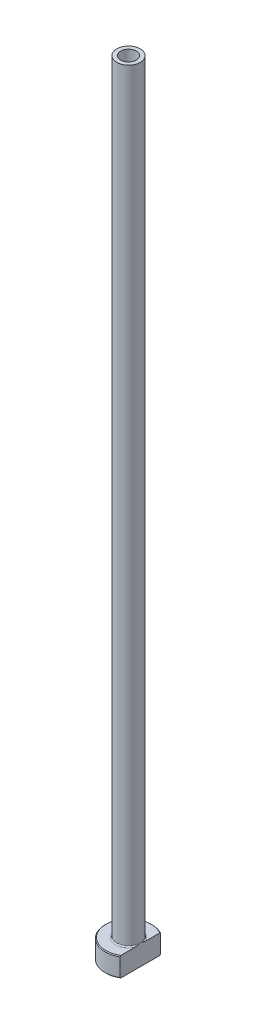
ISO-10303-21;
HEADER;
FILE_DESCRIPTION(('STEP AP214'),'2;1');
FILE_NAME('part.step','',(''),(''),'','','');
FILE_SCHEMA(('AUTOMOTIVE_DESIGN { 1 0 10303 214 1 1 1 1 }'));
ENDSEC;
DATA;
#1=APPLICATION_CONTEXT('core data for automotive mechanical design processes');
#2=APPLICATION_PROTOCOL_DEFINITION('international standard','automotive_design',2000,#1);
#3=PRODUCT_CONTEXT('',#1,'mechanical');
#4=PRODUCT('Part','Part','',(#3));
#5=PRODUCT_RELATED_PRODUCT_CATEGORY('part','',(#4));
#6=PRODUCT_DEFINITION_FORMATION('','',#4);
#7=PRODUCT_DEFINITION_CONTEXT('part definition',#1,'design');
#8=PRODUCT_DEFINITION('design','',#6,#7);
#9=PRODUCT_DEFINITION_SHAPE('','',#8);
#10=(LENGTH_UNIT() NAMED_UNIT(*) SI_UNIT(.MILLI.,.METRE.));
#11=(NAMED_UNIT(*) PLANE_ANGLE_UNIT() SI_UNIT($,.RADIAN.));
#12=(NAMED_UNIT(*) SI_UNIT($,.STERADIAN.) SOLID_ANGLE_UNIT());
#13=UNCERTAINTY_MEASURE_WITH_UNIT(LENGTH_MEASURE(1.E-05),#10,'distance_accuracy_value','');
#14=(GEOMETRIC_REPRESENTATION_CONTEXT(3) GLOBAL_UNCERTAINTY_ASSIGNED_CONTEXT((#13)) GLOBAL_UNIT_ASSIGNED_CONTEXT((#10,
#11,#12)) REPRESENTATION_CONTEXT('',''));
#15=CARTESIAN_POINT('',(0.,0.,0.));
#16=DIRECTION('',(0.,0.,1.));
#17=DIRECTION('',(1.,0.,0.));
#18=AXIS2_PLACEMENT_3D('',#15,#16,#17);
#19=CARTESIAN_POINT('',(0.,92.1876809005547,0.));
#20=DIRECTION('',(0.,1.,0.));
#21=DIRECTION('',(0.,0.,1.));
#22=AXIS2_PLACEMENT_3D('',#19,#20,#21);
#23=CYLINDRICAL_SURFACE('',#22,2.00000000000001);
#24=CARTESIAN_POINT('',(0.,200.,0.));
#25=DIRECTION('',(0.,1.,0.));
#26=DIRECTION('',(0.,0.,1.));
#27=AXIS2_PLACEMENT_3D('',#24,#25,#26);
#28=CIRCLE('',#27,2.);
#29=CARTESIAN_POINT('',(0.,200.,2.));
#30=VERTEX_POINT('',#29);
#31=EDGE_CURVE('E167',#30,#30,#28,.T.);
#32=ORIENTED_EDGE('',*,*,#31,.T.);
#33=EDGE_LOOP('',(#32));
#34=FACE_BOUND('',#33,.T.);
#35=CARTESIAN_POINT('',(0.,155.,0.));
#36=DIRECTION('',(0.,1.,0.));
#37=DIRECTION('',(0.,0.,1.));
#38=AXIS2_PLACEMENT_3D('',#35,#36,#37);
#39=CIRCLE('',#38,2.00000000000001);
#40=CARTESIAN_POINT('',(0.,155.,2.00000000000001));
#41=VERTEX_POINT('',#40);
#42=EDGE_CURVE('E170',#41,#41,#39,.T.);
#43=ORIENTED_EDGE('',*,*,#42,.F.);
#44=EDGE_LOOP('',(#43));
#45=FACE_BOUND('',#44,.T.);
#46=ADVANCED_FACE('F32',(#34,#45),#23,.F.);
#47=CARTESIAN_POINT('',(-2.,200.,0.));
#48=DIRECTION('',(0.,1.,0.));
#49=DIRECTION('',(0.,0.,1.));
#50=AXIS2_PLACEMENT_3D('',#47,#48,#49);
#51=PLANE('',#50);
#52=CARTESIAN_POINT('',(0.,200.,0.));
#53=DIRECTION('',(0.,1.,0.));
#54=DIRECTION('',(0.,0.,1.));
#55=AXIS2_PLACEMENT_3D('',#52,#53,#54);
#56=CIRCLE('',#55,3.00000000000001);
#57=CARTESIAN_POINT('',(0.,200.,3.00000000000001));
#58=VERTEX_POINT('',#57);
#59=EDGE_CURVE('E174',#58,#58,#56,.T.);
#60=ORIENTED_EDGE('',*,*,#59,.T.);
#61=EDGE_LOOP('',(#60));
#62=FACE_BOUND('',#61,.T.);
#63=ORIENTED_EDGE('',*,*,#31,.F.);
#64=EDGE_LOOP('',(#63));
#65=FACE_BOUND('',#64,.T.);
#66=ADVANCED_FACE('F157',(#62,#65),#51,.T.);
#67=CARTESIAN_POINT('',(0.,92.1876809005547,0.));
#68=DIRECTION('',(0.,1.,0.));
#69=DIRECTION('',(0.,0.,1.));
#70=AXIS2_PLACEMENT_3D('',#67,#68,#69);
#71=CYLINDRICAL_SURFACE('',#70,3.);
#72=CARTESIAN_POINT('',(0.,5.3,0.));
#73=DIRECTION('',(0.,1.,0.));
#74=DIRECTION('',(0.,0.,1.));
#75=AXIS2_PLACEMENT_3D('',#72,#73,#74);
#76=CIRCLE('',#75,3.);
#77=CARTESIAN_POINT('',(3.,5.3,0.));
#78=VERTEX_POINT('',#77);
#79=EDGE_CURVE('E180',#78,#78,#76,.T.);
#80=ORIENTED_EDGE('',*,*,#79,.T.);
#81=EDGE_LOOP('',(#80));
#82=FACE_BOUND('',#81,.T.);
#83=ORIENTED_EDGE('',*,*,#59,.F.);
#84=EDGE_LOOP('',(#83));
#85=FACE_BOUND('',#84,.T.);
#86=ADVANCED_FACE('F162',(#82,#85),#71,.T.);
#87=CARTESIAN_POINT('',(-2.99999999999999,5.,0.));
#88=DIRECTION('',(0.,1.,0.));
#89=DIRECTION('',(0.,0.,1.));
#90=AXIS2_PLACEMENT_3D('',#87,#88,#89);
#91=PLANE('',#90);
#92=DIRECTION('',(0.,0.,1.));
#93=VECTOR('',#92,1.);
#94=CARTESIAN_POINT('',(2.99999999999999,5.,0.));
#95=LINE('',#94,#93);
#96=CARTESIAN_POINT('',(3.,5.,-4.96386945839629));
#97=VERTEX_POINT('',#96);
#98=CARTESIAN_POINT('',(2.99999999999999,5.,-1.37477270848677));
#99=VERTEX_POINT('',#98);
#100=EDGE_CURVE('E54',#97,#99,#95,.T.);
#101=ORIENTED_EDGE('',*,*,#100,.F.);
#102=CARTESIAN_POINT('',(0.,5.,0.));
#103=DIRECTION('',(0.,1.,0.));
#104=DIRECTION('',(0.,0.,1.));
#105=AXIS2_PLACEMENT_3D('',#102,#103,#104);
#106=CIRCLE('',#105,5.79999999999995);
#107=CARTESIAN_POINT('',(2.99999999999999,5.,4.96386945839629));
#108=VERTEX_POINT('',#107);
#109=EDGE_CURVE('E186',#97,#108,#106,.T.);
#110=ORIENTED_EDGE('',*,*,#109,.T.);
#111=CARTESIAN_POINT('',(2.99999999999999,5.,1.37477270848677));
#112=VERTEX_POINT('',#111);
#113=EDGE_CURVE('E134',#112,#108,#95,.T.);
#114=ORIENTED_EDGE('',*,*,#113,.F.);
#115=CARTESIAN_POINT('',(0.,5.,0.));
#116=DIRECTION('',(0.,1.,0.));
#117=DIRECTION('',(0.,0.,1.));
#118=AXIS2_PLACEMENT_3D('',#115,#116,#117);
#119=CIRCLE('',#118,3.3);
#120=EDGE_CURVE('E183',#112,#99,#119,.F.);
#121=ORIENTED_EDGE('',*,*,#120,.T.);
#122=EDGE_LOOP('',(#101,#110,#114,#121));
#123=FACE_BOUND('',#122,.T.);
#124=ADVANCED_FACE('F197',(#123),#91,.T.);
#125=CARTESIAN_POINT('',(0.,92.1876809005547,0.));
#126=DIRECTION('',(0.,1.,0.));
#127=DIRECTION('',(0.,0.,1.));
#128=AXIS2_PLACEMENT_3D('',#125,#126,#127);
#129=CYLINDRICAL_SURFACE('',#128,5.99999999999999);
#130=DIRECTION('',(0.,-1.,0.));
#131=VECTOR('',#130,1.);
#132=CARTESIAN_POINT('',(2.99999999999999,200.,5.19615242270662));
#133=LINE('',#132,#131);
#134=CARTESIAN_POINT('',(2.99999999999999,4.79999999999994,5.19615242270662));
#135=VERTEX_POINT('',#134);
#136=CARTESIAN_POINT('',(2.99999999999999,0.20000000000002,5.19615242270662));
#137=VERTEX_POINT('',#136);
#138=EDGE_CURVE('E82',#135,#137,#133,.T.);
#139=ORIENTED_EDGE('',*,*,#138,.F.);
#140=CARTESIAN_POINT('',(0.,4.79999999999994,0.));
#141=DIRECTION('',(0.,1.,0.));
#142=DIRECTION('',(0.,0.,1.));
#143=AXIS2_PLACEMENT_3D('',#140,#141,#142);
#144=CIRCLE('',#143,5.99999999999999);
#145=CARTESIAN_POINT('',(3.,4.79999999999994,-5.19615242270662));
#146=VERTEX_POINT('',#145);
#147=EDGE_CURVE('E95',#135,#146,#144,.F.);
#148=ORIENTED_EDGE('',*,*,#147,.T.);
#149=DIRECTION('',(0.,-1.,0.));
#150=VECTOR('',#149,1.);
#151=CARTESIAN_POINT('',(3.,200.,-5.19615242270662));
#152=LINE('',#151,#150);
#153=CARTESIAN_POINT('',(3.,0.20000000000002,-5.19615242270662));
#154=VERTEX_POINT('',#153);
#155=EDGE_CURVE('E192',#146,#154,#152,.T.);
#156=ORIENTED_EDGE('',*,*,#155,.T.);
#157=CARTESIAN_POINT('',(0.,0.20000000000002,0.));
#158=DIRECTION('',(0.,-1.,0.));
#159=DIRECTION('',(0.,0.,-1.));
#160=AXIS2_PLACEMENT_3D('',#157,#158,#159);
#161=CIRCLE('',#160,5.99999999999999);
#162=EDGE_CURVE('E98',#154,#137,#161,.F.);
#163=ORIENTED_EDGE('',*,*,#162,.T.);
#164=EDGE_LOOP('',(#139,#148,#156,#163));
#165=FACE_BOUND('',#164,.T.);
#166=ADVANCED_FACE('F190',(#165),#129,.T.);
#167=CARTESIAN_POINT('',(-5.99999999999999,0.,0.));
#168=DIRECTION('',(0.,-1.,0.));
#169=DIRECTION('',(0.,0.,-1.));
#170=AXIS2_PLACEMENT_3D('',#167,#168,#169);
#171=PLANE('',#170);
#172=CARTESIAN_POINT('',(0.,0.,0.));
#173=DIRECTION('',(0.,-1.,0.));
#174=DIRECTION('',(0.,0.,-1.));
#175=AXIS2_PLACEMENT_3D('',#172,#173,#174);
#176=CIRCLE('',#175,2.75);
#177=CARTESIAN_POINT('',(0.,0.,-2.75));
#178=VERTEX_POINT('',#177);
#179=EDGE_CURVE('E40',#178,#178,#176,.F.);
#180=ORIENTED_EDGE('',*,*,#179,.T.);
#181=EDGE_LOOP('',(#180));
#182=FACE_BOUND('',#181,.T.);
#183=DIRECTION('',(0.,0.,-1.));
#184=VECTOR('',#183,1.);
#185=CARTESIAN_POINT('',(2.99999999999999,0.,5.19615242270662));
#186=LINE('',#185,#184);
#187=CARTESIAN_POINT('',(2.99999999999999,0.,4.96386945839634));
#188=VERTEX_POINT('',#187);
#189=CARTESIAN_POINT('',(3.,0.,-4.96386945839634));
#190=VERTEX_POINT('',#189);
#191=EDGE_CURVE('E47',#188,#190,#186,.T.);
#192=ORIENTED_EDGE('',*,*,#191,.F.);
#193=CARTESIAN_POINT('',(0.,0.,0.));
#194=DIRECTION('',(0.,-1.,0.));
#195=DIRECTION('',(0.,0.,-1.));
#196=AXIS2_PLACEMENT_3D('',#193,#194,#195);
#197=CIRCLE('',#196,5.8);
#198=EDGE_CURVE('E92',#188,#190,#197,.T.);
#199=ORIENTED_EDGE('',*,*,#198,.T.);
#200=EDGE_LOOP('',(#192,#199));
#201=FACE_BOUND('',#200,.T.);
#202=ADVANCED_FACE('F91',(#182,#201),#171,.T.);
#203=CARTESIAN_POINT('',(0.,92.1876809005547,0.));
#204=DIRECTION('',(0.,1.,0.));
#205=DIRECTION('',(0.,0.,1.));
#206=AXIS2_PLACEMENT_3D('',#203,#204,#205);
#207=CYLINDRICAL_SURFACE('',#206,2.25);
#208=CARTESIAN_POINT('',(0.,0.5,0.));
#209=DIRECTION('',(0.,-1.,0.));
#210=DIRECTION('',(0.,0.,-1.));
#211=AXIS2_PLACEMENT_3D('',#208,#209,#210);
#212=CIRCLE('',#211,2.25);
#213=CARTESIAN_POINT('',(0.,0.5,-2.25));
#214=VERTEX_POINT('',#213);
#215=EDGE_CURVE('E11',#214,#214,#212,.T.);
#216=ORIENTED_EDGE('',*,*,#215,.T.);
#217=EDGE_LOOP('',(#216));
#218=FACE_BOUND('',#217,.T.);
#219=CARTESIAN_POINT('',(0.,143.,0.));
#220=DIRECTION('',(0.,1.,0.));
#221=DIRECTION('',(0.,0.,1.));
#222=AXIS2_PLACEMENT_3D('',#219,#220,#221);
#223=CIRCLE('',#222,2.25000000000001);
#224=CARTESIAN_POINT('',(0.,143.,2.25000000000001));
#225=VERTEX_POINT('',#224);
#226=EDGE_CURVE('E172',#225,#225,#223,.T.);
#227=ORIENTED_EDGE('',*,*,#226,.T.);
#228=EDGE_LOOP('',(#227));
#229=FACE_BOUND('',#228,.T.);
#230=ADVANCED_FACE('F215',(#218,#229),#207,.F.);
#231=CARTESIAN_POINT('',(0.,143.,0.));
#232=DIRECTION('',(0.,-1.,0.));
#233=DIRECTION('',(0.,0.,-1.));
#234=AXIS2_PLACEMENT_3D('',#231,#232,#233);
#235=CONICAL_SURFACE('',#234,2.25000000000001,0.0208303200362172);
#236=ORIENTED_EDGE('',*,*,#42,.T.);
#237=EDGE_LOOP('',(#236));
#238=FACE_BOUND('',#237,.T.);
#239=ORIENTED_EDGE('',*,*,#226,.F.);
#240=EDGE_LOOP('',(#239));
#241=FACE_BOUND('',#240,.T.);
#242=ADVANCED_FACE('F111',(#238,#241),#235,.F.);
#243=CARTESIAN_POINT('',(0.,5.3,0.));
#244=DIRECTION('',(0.,1.,0.));
#245=DIRECTION('',(0.,0.,1.));
#246=AXIS2_PLACEMENT_3D('',#243,#244,#245);
#247=TOROIDAL_SURFACE('',#246,3.3,0.3);
#248=ORIENTED_EDGE('',*,*,#120,.F.);
#249=CARTESIAN_POINT('',(3.,5.3,0.));
#250=CARTESIAN_POINT('',(3.,5.30000062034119,-1.12611269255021E-10));
#251=CARTESIAN_POINT('',(3.,5.30000124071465,1.79706844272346E-07));
#252=CARTESIAN_POINT('',(3.,5.30000241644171,7.12597637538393E-07));
#253=CARTESIAN_POINT('',(3.,5.30000296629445,1.07470919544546E-06));
#254=CARTESIAN_POINT('',(3.,5.30000408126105,1.93940839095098E-06));
#255=CARTESIAN_POINT('',(3.,5.30000463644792,2.45488632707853E-06));
#256=CARTESIAN_POINT('',(3.,5.30000565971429,3.54465568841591E-06));
#257=CARTESIAN_POINT('',(3.,5.30000612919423,4.11770713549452E-06));
#258=CARTESIAN_POINT('',(3.,5.3000077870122,6.2539651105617E-06));
#259=CARTESIAN_POINT('',(3.,5.30000888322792,7.89070926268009E-06));
#260=CARTESIAN_POINT('',(3.,5.30001076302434,1.11998061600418E-05));
#261=CARTESIAN_POINT('',(3.,5.30001156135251,1.28642120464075E-05));
#262=CARTESIAN_POINT('',(3.,5.30001474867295,1.96537185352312E-05));
#263=CARTESIAN_POINT('',(3.,5.30001702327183,2.48380257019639E-05));
#264=CARTESIAN_POINT('',(3.,5.30002052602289,3.48178503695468E-05));
#265=CARTESIAN_POINT('',(3.,5.30002184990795,3.95800645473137E-05));
#266=CARTESIAN_POINT('',(3.,5.30003122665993,7.41814409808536E-05));
#267=CARTESIAN_POINT('',(3.,5.30003808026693,0.000104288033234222));
#268=CARTESIAN_POINT('',(3.,5.30006804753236,0.000222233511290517));
#269=CARTESIAN_POINT('',(3.,5.30009687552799,0.000308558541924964));
#270=CARTESIAN_POINT('',(3.,5.30020809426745,0.000648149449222));
#271=CARTESIAN_POINT('',(3.,5.30028657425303,0.000902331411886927));
#272=CARTESIAN_POINT('',(3.,5.30059876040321,0.00190491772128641));
#273=CARTESIAN_POINT('',(3.,5.30083723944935,0.00265218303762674));
#274=CARTESIAN_POINT('',(3.,5.30182192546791,0.00574694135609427));
#275=CARTESIAN_POINT('',(3.,5.30256224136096,0.00809584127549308));
#276=CARTESIAN_POINT('',(2.99999999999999,5.31160267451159,0.0367678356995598));
#277=CARTESIAN_POINT('',(3.,5.31993817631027,0.063082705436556));
#278=CARTESIAN_POINT('',(3.,5.33621504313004,0.114704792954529));
#279=CARTESIAN_POINT('',(3.,5.34415908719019,0.140011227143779));
#280=CARTESIAN_POINT('',(3.,5.360943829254,0.193774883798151));
#281=CARTESIAN_POINT('',(3.,5.36977415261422,0.222235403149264));
#282=CARTESIAN_POINT('',(3.,5.38736474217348,0.279512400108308));
#283=CARTESIAN_POINT('',(3.,5.39612323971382,0.308329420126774));
#284=CARTESIAN_POINT('',(3.,5.4172657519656,0.378880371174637));
#285=CARTESIAN_POINT('',(3.,5.42952723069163,0.420651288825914));
#286=CARTESIAN_POINT('',(3.,5.45309597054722,0.503357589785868));
#287=CARTESIAN_POINT('',(3.,5.464419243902,0.544288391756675));
#288=CARTESIAN_POINT('',(3.,5.48778169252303,0.632156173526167));
#289=CARTESIAN_POINT('',(3.,5.49969678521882,0.679126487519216));
#290=CARTESIAN_POINT('',(3.,5.52221484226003,0.773740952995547));
#291=CARTESIAN_POINT('',(3.,5.53280772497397,0.821387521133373));
#292=CARTESIAN_POINT('',(3.,5.55291503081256,0.920589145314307));
#293=CARTESIAN_POINT('',(3.,5.56229188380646,0.972172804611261));
#294=CARTESIAN_POINT('',(3.,5.57838694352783,1.07574836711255));
#295=CARTESIAN_POINT('',(3.,5.585105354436,1.12774023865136));
#296=CARTESIAN_POINT('',(3.,5.59681427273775,1.24924411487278));
#297=CARTESIAN_POINT('',(3.,5.60051317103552,1.31890364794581));
#298=CARTESIAN_POINT('',(3.,5.59966579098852,1.4227083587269));
#299=CARTESIAN_POINT('',(3.,5.59835823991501,1.45688093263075));
#300=CARTESIAN_POINT('',(3.,5.59322745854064,1.52502533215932));
#301=CARTESIAN_POINT('',(3.,5.58940645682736,1.55899730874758));
#302=CARTESIAN_POINT('',(3.,5.57976146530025,1.61947815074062));
#303=CARTESIAN_POINT('',(3.,5.57451506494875,1.64607760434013));
#304=CARTESIAN_POINT('',(3.,5.56161153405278,1.69883648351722));
#305=CARTESIAN_POINT('',(3.,5.55394338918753,1.72499331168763));
#306=CARTESIAN_POINT('',(3.,5.53555176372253,1.77650913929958));
#307=CARTESIAN_POINT('',(3.,5.52480031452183,1.80185836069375));
#308=CARTESIAN_POINT('',(3.,5.49948027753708,1.85054545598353));
#309=CARTESIAN_POINT('',(3.,5.48493141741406,1.87389291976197));
#310=CARTESIAN_POINT('',(3.,5.45992470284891,1.90552135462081));
#311=CARTESIAN_POINT('',(3.,5.45133318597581,1.91527363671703));
#312=CARTESIAN_POINT('',(3.,5.43294163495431,1.93360072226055));
#313=CARTESIAN_POINT('',(3.,5.42314083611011,1.94217477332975));
#314=CARTESIAN_POINT('',(3.,5.4021589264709,1.95778354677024));
#315=CARTESIAN_POINT('',(3.,5.39096156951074,1.96479687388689));
#316=CARTESIAN_POINT('',(3.,5.36742144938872,1.97652218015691));
#317=CARTESIAN_POINT('',(3.,5.35508207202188,1.98124071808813));
#318=CARTESIAN_POINT('',(3.,5.33320117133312,1.98690185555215));
#319=CARTESIAN_POINT('',(3.,5.32383559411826,1.98852953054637));
#320=CARTESIAN_POINT('',(3.,5.30496375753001,1.99016898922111));
#321=CARTESIAN_POINT('',(3.,5.29545756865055,1.9901815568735));
#322=CARTESIAN_POINT('',(3.,5.2765931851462,1.98858978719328));
#323=CARTESIAN_POINT('',(3.,5.26723486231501,1.98698693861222));
#324=CARTESIAN_POINT('',(3.,5.24889957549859,1.98229727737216));
#325=CARTESIAN_POINT('',(3.,5.23992286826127,1.97920948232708));
#326=CARTESIAN_POINT('',(3.,5.2198129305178,1.97059641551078));
#327=CARTESIAN_POINT('',(3.,5.2088771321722,1.96461176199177));
#328=CARTESIAN_POINT('',(3.,5.18811536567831,1.9509572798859));
#329=CARTESIAN_POINT('',(3.,5.1782917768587,1.94328393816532));
#330=CARTESIAN_POINT('',(3.,5.15512177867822,1.92254223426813));
#331=CARTESIAN_POINT('',(3.,5.14247568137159,1.9086968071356));
#332=CARTESIAN_POINT('',(3.,5.11944595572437,1.87927587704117));
#333=CARTESIAN_POINT('',(3.,5.10906527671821,1.86369815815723));
#334=CARTESIAN_POINT('',(3.,5.0830960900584,1.81927355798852));
#335=CARTESIAN_POINT('',(3.,5.06948546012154,1.78928084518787));
#336=CARTESIAN_POINT('',(3.,5.04658664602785,1.72751962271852));
#337=CARTESIAN_POINT('',(3.,5.03733582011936,1.69573828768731));
#338=CARTESIAN_POINT('',(3.,5.0221431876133,1.630799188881));
#339=CARTESIAN_POINT('',(3.,5.01626537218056,1.59762686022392));
#340=CARTESIAN_POINT('',(3.,5.00734002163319,1.53086029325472));
#341=CARTESIAN_POINT('',(3.,5.00429797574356,1.49726536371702));
#342=CARTESIAN_POINT('',(3.,5.00059037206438,1.43100872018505));
#343=CARTESIAN_POINT('',(3.,4.99985343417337,1.39835069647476));
#344=CARTESIAN_POINT('',(3.,5.00019322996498,1.33318312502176));
#345=CARTESIAN_POINT('',(3.,5.00126261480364,1.3006735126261));
#346=CARTESIAN_POINT('',(3.,5.00569854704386,1.22190465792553));
#347=CARTESIAN_POINT('',(3.,5.00984986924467,1.17569031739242));
#348=CARTESIAN_POINT('',(3.,5.02060876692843,1.08357061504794));
#349=CARTESIAN_POINT('',(3.,5.02721586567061,1.03766519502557));
#350=CARTESIAN_POINT('',(3.,5.04258096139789,0.945130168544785));
#351=CARTESIAN_POINT('',(3.,5.05138514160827,0.898508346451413));
#352=CARTESIAN_POINT('',(3.,5.07066869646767,0.80549666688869));
#353=CARTESIAN_POINT('',(3.,5.08115218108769,0.75910767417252));
#354=CARTESIAN_POINT('',(3.,5.10738921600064,0.650207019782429));
#355=CARTESIAN_POINT('',(3.,5.12369110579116,0.587828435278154));
#356=CARTESIAN_POINT('',(3.,5.15777680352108,0.464212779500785));
#357=CARTESIAN_POINT('',(3.,5.17554263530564,0.40297066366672));
#358=CARTESIAN_POINT('',(3.,5.21006724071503,0.287596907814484));
#359=CARTESIAN_POINT('',(3.,5.22671796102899,0.23343265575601));
#360=CARTESIAN_POINT('',(3.,5.25241226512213,0.150940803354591));
#361=CARTESIAN_POINT('',(3.,5.26131063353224,0.122567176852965));
#362=CARTESIAN_POINT('',(2.99999999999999,5.27905176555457,0.0662804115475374));
#363=CARTESIAN_POINT('',(2.99999999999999,5.28789327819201,0.0383669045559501));
#364=CARTESIAN_POINT('',(3.,5.29743877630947,0.00809257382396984));
#365=CARTESIAN_POINT('',(3.,5.29818012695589,0.00574041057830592));
#366=CARTESIAN_POINT('',(3.,5.29916506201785,0.00264489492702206));
#367=CARTESIAN_POINT('',(3.,5.29940274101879,0.0019001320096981));
#368=CARTESIAN_POINT('',(3.,5.29971394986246,0.000900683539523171));
#369=CARTESIAN_POINT('',(3.,5.29979223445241,0.000647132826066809));
#370=CARTESIAN_POINT('',(3.,5.29990321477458,0.000308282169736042));
#371=CARTESIAN_POINT('',(3.,5.29993200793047,0.000222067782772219));
#372=CARTESIAN_POINT('',(3.,5.29996194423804,0.000104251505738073));
#373=CARTESIAN_POINT('',(3.,5.29996879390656,7.41614247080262E-05));
#374=CARTESIAN_POINT('',(3.,5.29997816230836,3.95766708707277E-05));
#375=CARTESIAN_POINT('',(3.,5.29997948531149,3.4815466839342E-05));
#376=CARTESIAN_POINT('',(3.,5.29998298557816,2.48376281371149E-05));
#377=CARTESIAN_POINT('',(3.,5.29998525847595,1.9654245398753E-05));
#378=CARTESIAN_POINT('',(3.,5.29998844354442,1.28656654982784E-05));
#379=CARTESIAN_POINT('',(3.,5.29998924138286,1.12013349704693E-05));
#380=CARTESIAN_POINT('',(3.,5.29999112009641,7.89230029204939E-06));
#381=CARTESIAN_POINT('',(3.,5.29999221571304,6.25553534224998E-06));
#382=CARTESIAN_POINT('',(3.,5.29999387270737,4.11914367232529E-06));
#383=CARTESIAN_POINT('',(3.,5.29999434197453,3.54603094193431E-06));
#384=CARTESIAN_POINT('',(3.,5.29999536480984,2.45610068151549E-06));
#385=CARTESIAN_POINT('',(3.,5.29999591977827,1.94052228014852E-06));
#386=CARTESIAN_POINT('',(3.,5.29999703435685,1.07558322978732E-06));
#387=CARTESIAN_POINT('',(3.,5.29999758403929,7.13339441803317E-07));
#388=CARTESIAN_POINT('',(3.,5.2999987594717,1.8012193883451E-07));
#389=CARTESIAN_POINT('',(3.,5.29999937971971,1.12600713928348E-10));
#390=CARTESIAN_POINT('',(3.,5.3,0.));
#391=B_SPLINE_CURVE_WITH_KNOTS('',3,(#249,#250,#251,#252,#253,#254,#255,#256,#257,#258,#259,
#260,#261,#262,#263,#264,#265,#266,#267,#268,#269,#270,#271,#272,#273,#274,#275,#276,#277,#278,
#279,#280,#281,#282,#283,#284,#285,#286,#287,#288,#289,#290,#291,#292,#293,#294,#295,#296,#297,
#298,#299,#300,#301,#302,#303,#304,#305,#306,#307,#308,#309,#310,#311,#312,#313,#314,#315,#316,
#317,#318,#319,#320,#321,#322,#323,#324,#325,#326,#327,#328,#329,#330,#331,#332,#333,#334,#335,
#336,#337,#338,#339,#340,#341,#342,#343,#344,#345,#346,#347,#348,#349,#350,#351,#352,#353,#354,
#355,#356,#357,#358,#359,#360,#361,#362,#363,#364,#365,#366,#367,#368,#369,#370,#371,#372,#373,
#374,#375,#376,#377,#378,#379,#380,#381,#382,#383,#384,#385,#386,#387,#388,#389,#390),
.UNSPECIFIED.,.T.,.F.,(4,2,2,2,2,2,2,2,2,2,2,2,2,2,2,2,2,2,2,2,2,2,2,2,2,2,2,2,2,2,2,2,2,2,2,2,
2,2,2,2,2,2,2,2,2,2,2,2,2,2,2,2,2,2,2,2,2,2,2,2,2,2,2,2,2,2,2,2,2,2,4),(0.,1.86513838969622E-06,
3.83353198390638E-06,6.09513172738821E-06,8.3156045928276E-06,1.42000688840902E-05,
1.97335485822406E-05,3.66769849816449E-05,5.14858298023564E-05,0.000144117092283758,
0.000416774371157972,0.00121521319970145,0.00356794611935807,0.0109568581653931,
0.093763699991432,0.173336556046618,0.262732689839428,0.35308814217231,0.483684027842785,
0.611082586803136,0.756439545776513,0.902844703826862,1.06007042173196,1.21728406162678,
1.42611662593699,1.52864191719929,1.63107642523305,1.71232857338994,1.79395571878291,
1.87634808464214,1.95832065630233,1.99722769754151,2.03615946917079,2.0755959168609,
2.11491897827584,2.14330913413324,2.17168550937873,2.20003575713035,2.2284047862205,
2.26559554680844,2.3028644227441,2.35880214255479,2.41481225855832,2.51307007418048,
2.61215518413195,2.71306273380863,2.81416520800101,2.91210427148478,3.0096458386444,
3.14875779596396,3.28784276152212,3.43014232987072,3.57279564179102,3.76617940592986,
3.95746724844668,4.12746077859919,4.21667041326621,4.30450746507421,4.31190664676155,
4.31425150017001,4.31504795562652,4.31532026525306,4.31541284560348,4.31542765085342,
4.3154445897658,4.31545012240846,4.31545600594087,4.31545822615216,4.3154604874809,
4.31546245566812,4.31546432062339),.UNSPECIFIED.);
#392=EDGE_CURVE('E126',#112,#78,#391,.T.);
#393=ORIENTED_EDGE('',*,*,#392,.T.);
#394=ORIENTED_EDGE('',*,*,#79,.F.);
#395=CARTESIAN_POINT('',(3.,5.3,0.));
#396=CARTESIAN_POINT('',(3.,5.29999937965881,1.12611892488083E-10));
#397=CARTESIAN_POINT('',(3.,5.29999875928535,-1.79706843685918E-07));
#398=CARTESIAN_POINT('',(3.,5.29999758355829,-7.12597636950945E-07));
#399=CARTESIAN_POINT('',(3.,5.29999703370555,-1.0747091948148E-06));
#400=CARTESIAN_POINT('',(3.,5.29999591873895,-1.93940839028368E-06));
#401=CARTESIAN_POINT('',(3.,5.29999536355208,-2.454886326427E-06));
#402=CARTESIAN_POINT('',(3.,5.2999943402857,-3.544655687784E-06));
#403=CARTESIAN_POINT('',(3.,5.29999387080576,-4.11770713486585E-06));
#404=CARTESIAN_POINT('',(3.,5.2999922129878,-6.25396510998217E-06));
#405=CARTESIAN_POINT('',(3.,5.29999111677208,-7.89070926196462E-06));
#406=CARTESIAN_POINT('',(3.,5.29998923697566,-1.11998061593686E-05));
#407=CARTESIAN_POINT('',(3.,5.29998843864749,-1.28642120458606E-05));
#408=CARTESIAN_POINT('',(3.,5.29998525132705,-1.96537185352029E-05));
#409=CARTESIAN_POINT('',(3.,5.29998297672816,-2.48380257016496E-05));
#410=CARTESIAN_POINT('',(3.,5.29997947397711,-3.48178503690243E-05));
#411=CARTESIAN_POINT('',(3.,5.29997815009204,-3.95800645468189E-05));
#412=CARTESIAN_POINT('',(3.,5.29996877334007,-7.41814409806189E-05));
#413=CARTESIAN_POINT('',(3.,5.29996191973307,-0.000104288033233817));
#414=CARTESIAN_POINT('',(3.,5.29993195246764,-0.000222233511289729));
#415=CARTESIAN_POINT('',(3.,5.29990312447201,-0.000308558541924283));
#416=CARTESIAN_POINT('',(3.,5.29979190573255,-0.000648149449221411));
#417=CARTESIAN_POINT('',(3.,5.29971342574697,-0.000902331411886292));
#418=CARTESIAN_POINT('',(3.,5.29940123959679,-0.00190491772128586));
#419=CARTESIAN_POINT('',(3.,5.29916276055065,-0.00265218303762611));
#420=CARTESIAN_POINT('',(3.,5.29817807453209,-0.00574694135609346));
#421=CARTESIAN_POINT('',(3.,5.29743775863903,-0.00809584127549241));
#422=CARTESIAN_POINT('',(2.99999999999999,5.28839732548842,-0.0367678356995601));
#423=CARTESIAN_POINT('',(3.,5.28006182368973,-0.0630827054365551));
#424=CARTESIAN_POINT('',(3.,5.26378495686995,-0.114704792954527));
#425=CARTESIAN_POINT('',(3.,5.25584091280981,-0.140011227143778));
#426=CARTESIAN_POINT('',(3.,5.239056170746,-0.193774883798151));
#427=CARTESIAN_POINT('',(3.,5.23022584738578,-0.222235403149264));
#428=CARTESIAN_POINT('',(3.,5.21263525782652,-0.279512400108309));
#429=CARTESIAN_POINT('',(3.,5.20387676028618,-0.308329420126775));
#430=CARTESIAN_POINT('',(3.,5.18273424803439,-0.378880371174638));
#431=CARTESIAN_POINT('',(3.,5.17047276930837,-0.420651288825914));
#432=CARTESIAN_POINT('',(3.,5.14690402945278,-0.503357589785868));
#433=CARTESIAN_POINT('',(3.,5.135580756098,-0.544288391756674));
#434=CARTESIAN_POINT('',(3.,5.11221830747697,-0.632156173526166));
#435=CARTESIAN_POINT('',(3.,5.10030321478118,-0.679126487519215));
#436=CARTESIAN_POINT('',(3.,5.07778515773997,-0.773740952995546));
#437=CARTESIAN_POINT('',(3.,5.06719227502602,-0.821387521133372));
#438=CARTESIAN_POINT('',(3.,5.04708496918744,-0.920589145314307));
#439=CARTESIAN_POINT('',(3.,5.03770811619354,-0.972172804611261));
#440=CARTESIAN_POINT('',(3.,5.02161305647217,-1.07574836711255));
#441=CARTESIAN_POINT('',(3.,5.014894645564,-1.12774023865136));
#442=CARTESIAN_POINT('',(3.,5.00318572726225,-1.24924411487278));
#443=CARTESIAN_POINT('',(3.,4.99948682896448,-1.31890364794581));
#444=CARTESIAN_POINT('',(3.,5.00033420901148,-1.4227083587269));
#445=CARTESIAN_POINT('',(3.,5.00164176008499,-1.45688093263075));
#446=CARTESIAN_POINT('',(3.,5.00677254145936,-1.52502533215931));
#447=CARTESIAN_POINT('',(3.,5.01059354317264,-1.55899730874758));
#448=CARTESIAN_POINT('',(3.,5.02023853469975,-1.61947815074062));
#449=CARTESIAN_POINT('',(3.,5.02548493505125,-1.64607760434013));
#450=CARTESIAN_POINT('',(3.,5.03838846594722,-1.69883648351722));
#451=CARTESIAN_POINT('',(3.,5.04605661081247,-1.72499331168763));
#452=CARTESIAN_POINT('',(3.,5.06444823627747,-1.77650913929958));
#453=CARTESIAN_POINT('',(3.,5.07519968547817,-1.80185836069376));
#454=CARTESIAN_POINT('',(3.,5.10051972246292,-1.85054545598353));
#455=CARTESIAN_POINT('',(3.,5.11506858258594,-1.87389291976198));
#456=CARTESIAN_POINT('',(3.,5.14007529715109,-1.90552135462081));
#457=CARTESIAN_POINT('',(3.,5.14866681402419,-1.91527363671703));
#458=CARTESIAN_POINT('',(3.,5.16705836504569,-1.93360072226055));
#459=CARTESIAN_POINT('',(3.,5.17685916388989,-1.94217477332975));
#460=CARTESIAN_POINT('',(3.,5.1978410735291,-1.95778354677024));
#461=CARTESIAN_POINT('',(3.,5.20903843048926,-1.96479687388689));
#462=CARTESIAN_POINT('',(3.,5.23257855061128,-1.97652218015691));
#463=CARTESIAN_POINT('',(3.,5.24491792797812,-1.98124071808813));
#464=CARTESIAN_POINT('',(3.,5.26679882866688,-1.98690185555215));
#465=CARTESIAN_POINT('',(3.,5.27616440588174,-1.98852953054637));
#466=CARTESIAN_POINT('',(3.,5.29503624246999,-1.99016898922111));
#467=CARTESIAN_POINT('',(3.,5.30454243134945,-1.99018155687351));
#468=CARTESIAN_POINT('',(3.,5.3234068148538,-1.98858978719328));
#469=CARTESIAN_POINT('',(3.,5.33276513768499,-1.98698693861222));
#470=CARTESIAN_POINT('',(3.,5.35110042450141,-1.98229727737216));
#471=CARTESIAN_POINT('',(3.,5.36007713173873,-1.97920948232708));
#472=CARTESIAN_POINT('',(3.,5.3801870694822,-1.97059641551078));
#473=CARTESIAN_POINT('',(3.,5.3911228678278,-1.96461176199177));
#474=CARTESIAN_POINT('',(3.,5.41188463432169,-1.9509572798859));
#475=CARTESIAN_POINT('',(3.,5.4217082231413,-1.94328393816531));
#476=CARTESIAN_POINT('',(3.,5.44487822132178,-1.92254223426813));
#477=CARTESIAN_POINT('',(3.,5.45752431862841,-1.9086968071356));
#478=CARTESIAN_POINT('',(3.,5.48055404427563,-1.87927587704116));
#479=CARTESIAN_POINT('',(3.,5.49093472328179,-1.86369815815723));
#480=CARTESIAN_POINT('',(3.,5.5169039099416,-1.81927355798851));
#481=CARTESIAN_POINT('',(3.,5.53051453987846,-1.78928084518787));
#482=CARTESIAN_POINT('',(3.,5.55341335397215,-1.72751962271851));
#483=CARTESIAN_POINT('',(3.,5.56266417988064,-1.6957382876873));
#484=CARTESIAN_POINT('',(3.,5.5778568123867,-1.63079918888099));
#485=CARTESIAN_POINT('',(3.,5.58373462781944,-1.59762686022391));
#486=CARTESIAN_POINT('',(3.,5.59265997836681,-1.5308602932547));
#487=CARTESIAN_POINT('',(3.,5.59570202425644,-1.497265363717));
#488=CARTESIAN_POINT('',(3.,5.59940962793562,-1.43100872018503));
#489=CARTESIAN_POINT('',(3.,5.60014656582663,-1.39835069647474));
#490=CARTESIAN_POINT('',(3.,5.59980677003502,-1.33318312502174));
#491=CARTESIAN_POINT('',(3.,5.59873738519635,-1.30067351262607));
#492=CARTESIAN_POINT('',(3.,5.59430145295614,-1.22190465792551));
#493=CARTESIAN_POINT('',(3.,5.59015013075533,-1.1756903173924));
#494=CARTESIAN_POINT('',(3.,5.57939123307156,-1.08357061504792));
#495=CARTESIAN_POINT('',(3.,5.57278413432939,-1.03766519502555));
#496=CARTESIAN_POINT('',(3.,5.5574190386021,-0.945130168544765));
#497=CARTESIAN_POINT('',(3.,5.54861485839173,-0.898508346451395));
#498=CARTESIAN_POINT('',(3.,5.52933130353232,-0.805496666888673));
#499=CARTESIAN_POINT('',(3.,5.5188478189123,-0.759107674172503));
#500=CARTESIAN_POINT('',(3.,5.49261078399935,-0.650207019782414));
#501=CARTESIAN_POINT('',(3.,5.47630889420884,-0.587828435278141));
#502=CARTESIAN_POINT('',(3.,5.44222319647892,-0.464212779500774));
#503=CARTESIAN_POINT('',(3.,5.42445736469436,-0.402970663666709));
#504=CARTESIAN_POINT('',(3.,5.38993275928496,-0.287596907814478));
#505=CARTESIAN_POINT('',(3.,5.373282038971,-0.233432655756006));
#506=CARTESIAN_POINT('',(3.,5.34758773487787,-0.150940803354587));
#507=CARTESIAN_POINT('',(3.,5.33868936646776,-0.122567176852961));
#508=CARTESIAN_POINT('',(2.99999999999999,5.32094823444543,-0.0662804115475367));
#509=CARTESIAN_POINT('',(2.99999999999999,5.31210672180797,-0.0383669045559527));
#510=CARTESIAN_POINT('',(3.,5.30256122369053,-0.00809257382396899));
#511=CARTESIAN_POINT('',(3.,5.30181987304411,-0.00574041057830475));
#512=CARTESIAN_POINT('',(3.,5.30083493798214,-0.00264489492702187));
#513=CARTESIAN_POINT('',(3.,5.30059725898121,-0.00190013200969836));
#514=CARTESIAN_POINT('',(3.,5.30028605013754,-0.000900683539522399));
#515=CARTESIAN_POINT('',(3.,5.3002077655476,-0.000647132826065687));
#516=CARTESIAN_POINT('',(3.,5.30009678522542,-0.000308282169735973));
#517=CARTESIAN_POINT('',(3.,5.30006799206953,-0.000222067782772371));
#518=CARTESIAN_POINT('',(3.,5.30003805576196,-0.000104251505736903));
#519=CARTESIAN_POINT('',(3.,5.30003120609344,-7.41614247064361E-05));
#520=CARTESIAN_POINT('',(3.,5.30002183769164,-3.95766708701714E-05));
#521=CARTESIAN_POINT('',(3.,5.30002051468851,-3.48154668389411E-05));
#522=CARTESIAN_POINT('',(3.,5.30001701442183,-2.48376281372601E-05));
#523=CARTESIAN_POINT('',(3.,5.30001474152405,-1.96542453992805E-05));
#524=CARTESIAN_POINT('',(3.,5.30001155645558,-1.28656654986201E-05));
#525=CARTESIAN_POINT('',(3.,5.30001075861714,-1.1201334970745E-05));
#526=CARTESIAN_POINT('',(3.,5.30000887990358,-7.89230029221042E-06));
#527=CARTESIAN_POINT('',(3.,5.30000778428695,-6.25553534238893E-06));
#528=CARTESIAN_POINT('',(3.,5.30000612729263,-4.1191436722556E-06));
#529=CARTESIAN_POINT('',(3.,5.30000565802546,-3.54603094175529E-06));
#530=CARTESIAN_POINT('',(3.,5.30000463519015,-2.45610068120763E-06));
#531=CARTESIAN_POINT('',(3.,5.30000408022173,-1.94052227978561E-06));
#532=CARTESIAN_POINT('',(3.,5.30000296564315,-1.07558322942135E-06));
#533=CARTESIAN_POINT('',(3.,5.30000241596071,-7.13339441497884E-07));
#534=CARTESIAN_POINT('',(3.,5.3000012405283,-1.80121938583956E-07));
#535=CARTESIAN_POINT('',(3.,5.30000062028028,-1.12600335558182E-10));
#536=CARTESIAN_POINT('',(3.,5.3,0.));
#537=B_SPLINE_CURVE_WITH_KNOTS('',3,(#395,#396,#397,#398,#399,#400,#401,#402,#403,#404,#405,
#406,#407,#408,#409,#410,#411,#412,#413,#414,#415,#416,#417,#418,#419,#420,#421,#422,#423,#424,
#425,#426,#427,#428,#429,#430,#431,#432,#433,#434,#435,#436,#437,#438,#439,#440,#441,#442,#443,
#444,#445,#446,#447,#448,#449,#450,#451,#452,#453,#454,#455,#456,#457,#458,#459,#460,#461,#462,
#463,#464,#465,#466,#467,#468,#469,#470,#471,#472,#473,#474,#475,#476,#477,#478,#479,#480,#481,
#482,#483,#484,#485,#486,#487,#488,#489,#490,#491,#492,#493,#494,#495,#496,#497,#498,#499,#500,
#501,#502,#503,#504,#505,#506,#507,#508,#509,#510,#511,#512,#513,#514,#515,#516,#517,#518,#519,
#520,#521,#522,#523,#524,#525,#526,#527,#528,#529,#530,#531,#532,#533,#534,#535,#536),
.UNSPECIFIED.,.T.,.F.,(4,2,2,2,2,2,2,2,2,2,2,2,2,2,2,2,2,2,2,2,2,2,2,2,2,2,2,2,2,2,2,2,2,2,2,2,
2,2,2,2,2,2,2,2,2,2,2,2,2,2,2,2,2,2,2,2,2,2,2,2,2,2,2,2,2,2,2,2,2,2,4),(0.,1.86513838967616E-06,
3.83353198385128E-06,6.09513172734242E-06,8.31560459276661E-06,1.42000688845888E-05,
1.97335485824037E-05,3.66769849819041E-05,5.14858298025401E-05,0.000144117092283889,
0.000416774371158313,0.0012152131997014,0.00356794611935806,0.0109568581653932,
0.0937636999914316,0.173336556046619,0.262732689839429,0.353088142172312,0.483684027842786,
0.611082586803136,0.756439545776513,0.902844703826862,1.06007042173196,1.21728406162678,
1.42611662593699,1.52864191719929,1.63107642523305,1.71232857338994,1.79395571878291,
1.87634808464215,1.95832065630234,1.99722769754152,2.03615946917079,2.0755959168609,
2.11491897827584,2.14330913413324,2.17168550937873,2.20003575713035,2.2284047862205,
2.26559554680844,2.3028644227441,2.35880214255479,2.41481225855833,2.51307007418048,
2.61215518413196,2.71306273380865,2.81416520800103,2.9121042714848,3.00964583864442,
3.14875779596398,3.28784276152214,3.43014232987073,3.57279564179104,3.76617940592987,
3.95746724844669,4.12746077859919,4.21667041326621,4.30450746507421,4.31190664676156,
4.31425150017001,4.31504795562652,4.31532026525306,4.31541284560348,4.31542765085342,
4.3154445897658,4.31545012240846,4.31545600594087,4.31545822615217,4.3154604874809,
4.31546245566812,4.31546432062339),.UNSPECIFIED.);
#538=EDGE_CURVE('E135',#78,#99,#537,.T.);
#539=ORIENTED_EDGE('',*,*,#538,.T.);
#540=EDGE_LOOP('',(#248,#393,#394,#539));
#541=FACE_BOUND('',#540,.T.);
#542=ADVANCED_FACE('F141',(#541),#247,.F.);
#543=CARTESIAN_POINT('',(0.,5.,0.));
#544=DIRECTION('',(0.,-1.,0.));
#545=DIRECTION('',(0.,0.,-1.));
#546=AXIS2_PLACEMENT_3D('',#543,#544,#545);
#547=CONICAL_SURFACE('',#546,5.79999999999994,0.785398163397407);
#548=CARTESIAN_POINT('',(3.,-1.01993959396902,-11.432889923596));
#549=CARTESIAN_POINT('',(3.,-0.769424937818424,-11.1738796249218));
#550=CARTESIAN_POINT('',(3.,-0.519179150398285,-10.9146084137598));
#551=CARTESIAN_POINT('',(3.,-0.0193842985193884,-10.395389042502));
#552=CARTESIAN_POINT('',(3.,0.23016475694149,-10.1354408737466));
#553=CARTESIAN_POINT('',(3.,0.728528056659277,-9.61458602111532));
#554=CARTESIAN_POINT('',(3.,0.977341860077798,-9.353678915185));
#555=CARTESIAN_POINT('',(3.,1.47386965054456,-8.83082274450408));
#556=CARTESIAN_POINT('',(3.,1.7215836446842,-8.56887368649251));
#557=CARTESIAN_POINT('',(3.,2.21069282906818,-8.04884148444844));
#558=CARTESIAN_POINT('',(3.,2.45211594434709,-7.79078462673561));
#559=CARTESIAN_POINT('',(3.,2.93315589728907,-7.2729934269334));
#560=CARTESIAN_POINT('',(3.,3.17277274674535,-7.01325909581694));
#561=CARTESIAN_POINT('',(3.,3.64950020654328,-6.49159990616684));
#562=CARTESIAN_POINT('',(3.,3.88661134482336,-6.22967553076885));
#563=CARTESIAN_POINT('',(3.,4.35738571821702,-5.70275148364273));
#564=CARTESIAN_POINT('',(3.,4.59104909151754,-5.43775193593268));
#565=CARTESIAN_POINT('',(3.,4.96416348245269,-5.00636825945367));
#566=CARTESIAN_POINT('',(3.,5.10520133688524,-4.84135845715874));
#567=CARTESIAN_POINT('',(3.,5.3847667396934,-4.50919282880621));
#568=CARTESIAN_POINT('',(3.,5.52329404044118,-4.34203679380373));
#569=CARTESIAN_POINT('',(3.,5.79842961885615,-4.00319933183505));
#570=CARTESIAN_POINT('',(3.,5.93500216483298,-3.83148875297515));
#571=CARTESIAN_POINT('',(3.,6.20336281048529,-3.4844211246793));
#572=CARTESIAN_POINT('',(3.,6.33515205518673,-3.30906496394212));
#573=CARTESIAN_POINT('',(3.,6.59393382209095,-2.95070802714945));
#574=CARTESIAN_POINT('',(3.,6.72082315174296,-2.76763161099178));
#575=CARTESIAN_POINT('',(3.,6.90336321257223,-2.48771743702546));
#576=CARTESIAN_POINT('',(3.,6.96295431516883,-2.3934539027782));
#577=CARTESIAN_POINT('',(3.,7.07882720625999,-2.20292146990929));
#578=CARTESIAN_POINT('',(3.,7.13510937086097,-2.10665280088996));
#579=CARTESIAN_POINT('',(3.,7.24288059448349,-1.91297779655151));
#580=CARTESIAN_POINT('',(3.,7.29441986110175,-1.81559978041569));
#581=CARTESIAN_POINT('',(3.,7.39241237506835,-1.61833215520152));
#582=CARTESIAN_POINT('',(3.,7.43886469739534,-1.51844209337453));
#583=CARTESIAN_POINT('',(3.,7.56840030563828,-1.21511948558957));
#584=CARTESIAN_POINT('',(3.,7.64209011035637,-1.00730397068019));
#585=CARTESIAN_POINT('',(3.,7.72186700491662,-0.695731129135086));
#586=CARTESIAN_POINT('',(3.,7.74302901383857,-0.595791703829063));
#587=CARTESIAN_POINT('',(3.,7.775825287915,-0.394325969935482));
#588=CARTESIAN_POINT('',(3.,7.78746040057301,-0.292799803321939));
#589=CARTESIAN_POINT('',(3.,7.80037895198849,-0.0893987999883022));
#590=CARTESIAN_POINT('',(3.,7.80169449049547,0.0124739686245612));
#591=CARTESIAN_POINT('',(3.,7.79396363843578,0.215826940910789));
#592=CARTESIAN_POINT('',(3.,7.78491639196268,0.317307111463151));
#593=CARTESIAN_POINT('',(3.,7.75721241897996,0.518039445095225));
#594=CARTESIAN_POINT('',(3.,7.73863812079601,0.617303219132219));
#595=CARTESIAN_POINT('',(3.,7.69303955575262,0.813850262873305));
#596=CARTESIAN_POINT('',(3.,7.6660142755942,0.911133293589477));
#597=CARTESIAN_POINT('',(3.,7.60464499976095,1.10394843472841));
#598=CARTESIAN_POINT('',(3.,7.57025976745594,1.19946724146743));
#599=CARTESIAN_POINT('',(3.,7.49555762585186,1.38810736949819));
#600=CARTESIAN_POINT('',(3.,7.45524192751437,1.48122917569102));
#601=CARTESIAN_POINT('',(3.,7.36961028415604,1.66561491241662));
#602=CARTESIAN_POINT('',(3.,7.32427350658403,1.75686908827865));
#603=CARTESIAN_POINT('',(3.,7.2296607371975,1.93732130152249));
#604=CARTESIAN_POINT('',(3.,7.18038388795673,2.02651888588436));
#605=CARTESIAN_POINT('',(3.,7.02771106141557,2.29153460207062));
#606=CARTESIAN_POINT('',(2.99999999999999,6.91955486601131,2.4646062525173));
#607=CARTESIAN_POINT('',(2.99999999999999,6.69440299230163,2.80577028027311));
#608=CARTESIAN_POINT('',(2.99999999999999,6.57737415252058,2.97384034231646));
#609=CARTESIAN_POINT('',(2.99999999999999,6.33748949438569,3.30561771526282));
#610=CARTESIAN_POINT('',(2.99999999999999,6.21463662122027,3.46932716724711));
#611=CARTESIAN_POINT('',(2.99999999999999,5.96308085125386,3.79561670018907));
#612=CARTESIAN_POINT('',(2.99999999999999,5.83432224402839,3.95815356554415));
#613=CARTESIAN_POINT('',(2.99999999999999,5.57361365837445,4.28066737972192));
#614=CARTESIAN_POINT('',(2.99999999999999,5.44166333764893,4.44064405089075));
#615=CARTESIAN_POINT('',(2.99999999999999,5.17568445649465,4.75819552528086));
#616=CARTESIAN_POINT('',(2.99999999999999,5.0416617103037,4.91577521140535));
#617=CARTESIAN_POINT('',(2.99999999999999,4.77176230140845,5.22934053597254));
#618=CARTESIAN_POINT('',(2.99999999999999,4.63588560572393,5.3853261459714));
#619=CARTESIAN_POINT('',(2.99999999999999,4.27256222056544,5.79849838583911));
#620=CARTESIAN_POINT('',(2.99999999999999,4.04384014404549,6.05456265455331));
#621=CARTESIAN_POINT('',(2.99999999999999,3.58360020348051,6.56417037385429));
#622=CARTESIAN_POINT('',(2.99999999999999,3.35208226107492,6.81771375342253));
#623=CARTESIAN_POINT('',(2.99999999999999,2.88678846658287,7.32315936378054));
#624=CARTESIAN_POINT('',(2.99999999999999,2.65301069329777,7.57505982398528));
#625=CARTESIAN_POINT('',(2.99999999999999,2.18392232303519,8.07742926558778));
#626=CARTESIAN_POINT('',(2.99999999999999,1.94861172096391,8.32789824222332));
#627=CARTESIAN_POINT('',(2.99999999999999,1.48651581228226,8.81743943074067));
#628=CARTESIAN_POINT('',(2.99999999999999,1.25977806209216,9.05655656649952));
#629=CARTESIAN_POINT('',(2.99999999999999,0.805439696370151,9.53397105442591));
#630=CARTESIAN_POINT('',(2.99999999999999,0.577839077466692,9.77226840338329));
#631=CARTESIAN_POINT('',(2.99999999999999,0.122198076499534,10.2479325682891));
#632=CARTESIAN_POINT('',(2.99999999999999,-0.10584153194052,10.4853001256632));
#633=CARTESIAN_POINT('',(2.99999999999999,-0.562491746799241,10.9594816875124));
#634=CARTESIAN_POINT('',(2.99999999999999,-0.791102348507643,11.1962956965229));
#635=CARTESIAN_POINT('',(2.99999999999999,-1.01993959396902,11.432889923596));
#636=B_SPLINE_CURVE_WITH_KNOTS('',3,(#548,#549,#550,#551,#552,#553,#554,#555,#556,#557,#558,
#559,#560,#561,#562,#563,#564,#565,#566,#567,#568,#569,#570,#571,#572,#573,#574,#575,#576,#577,
#578,#579,#580,#581,#582,#583,#584,#585,#586,#587,#588,#589,#590,#591,#592,#593,#594,#595,#596,
#597,#598,#599,#600,#601,#602,#603,#604,#605,#606,#607,#608,#609,#610,#611,#612,#613,#614,#615,
#616,#617,#618,#619,#620,#621,#622,#623,#624,#625,#626,#627,#628,#629,#630,#631,#632,#633,#634,
#635),.UNSPECIFIED.,.F.,.F.,(4,2,2,2,2,2,2,2,2,2,2,2,2,2,2,2,2,2,2,2,2,2,2,2,2,2,2,2,2,2,2,2,2,
2,2,2,2,2,2,2,2,2,2,4),(0.,1.08101662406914,2.16204714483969,3.24363027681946,4.32520642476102,
5.38534462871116,6.445475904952,7.50537917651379,8.56523985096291,9.21643479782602,
9.86769362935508,10.52583232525,11.183812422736,11.8517813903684,12.1862877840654,
12.5207560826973,12.85113322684,13.1815703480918,13.839916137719,14.1460077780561,
14.452072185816,14.7571841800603,15.0623213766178,15.3648619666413,15.6674388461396,
15.971757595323,16.2760142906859,16.5815843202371,16.88722102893,17.4990577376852,
18.1133060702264,18.7272470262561,19.3492675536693,19.971355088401,20.5919343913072,
21.212524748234,22.2425132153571,23.2725306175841,24.3035181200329,25.3345090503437,
26.3230827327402,27.31166028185,28.2991352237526,29.286602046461),.UNSPECIFIED.);
#637=EDGE_CURVE('E133',#146,#97,#636,.T.);
#638=ORIENTED_EDGE('',*,*,#637,.F.);
#639=ORIENTED_EDGE('',*,*,#147,.F.);
#640=EDGE_CURVE('E118',#108,#135,#636,.T.);
#641=ORIENTED_EDGE('',*,*,#640,.F.);
#642=ORIENTED_EDGE('',*,*,#109,.F.);
#643=EDGE_LOOP('',(#638,#639,#641,#642));
#644=FACE_BOUND('',#643,.T.);
#645=ADVANCED_FACE('F145',(#644),#547,.T.);
#646=CARTESIAN_POINT('',(0.,0.20000000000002,0.));
#647=DIRECTION('',(0.,1.,0.));
#648=DIRECTION('',(0.,0.,1.));
#649=AXIS2_PLACEMENT_3D('',#646,#647,#648);
#650=CONICAL_SURFACE('',#649,5.99999999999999,0.785398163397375);
#651=CARTESIAN_POINT('',(2.99999999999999,6.01993959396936,11.432889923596));
#652=CARTESIAN_POINT('',(2.99999999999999,5.76942493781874,11.1738796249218));
#653=CARTESIAN_POINT('',(2.99999999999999,5.51917915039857,10.9146084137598));
#654=CARTESIAN_POINT('',(2.99999999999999,5.01938429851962,10.3953890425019));
#655=CARTESIAN_POINT('',(2.99999999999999,4.76983524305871,10.1354408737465));
#656=CARTESIAN_POINT('',(2.99999999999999,4.27147194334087,9.61458602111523));
#657=CARTESIAN_POINT('',(2.99999999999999,4.02265813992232,9.3536789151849));
#658=CARTESIAN_POINT('',(2.99999999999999,3.5261303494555,8.83082274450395));
#659=CARTESIAN_POINT('',(2.99999999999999,3.27841635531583,8.56887368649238));
#660=CARTESIAN_POINT('',(2.99999999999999,2.7893071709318,8.04884148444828));
#661=CARTESIAN_POINT('',(2.99999999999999,2.54788405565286,7.79078462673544));
#662=CARTESIAN_POINT('',(2.99999999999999,2.06684410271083,7.2729934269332));
#663=CARTESIAN_POINT('',(2.99999999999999,1.82722725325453,7.01325909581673));
#664=CARTESIAN_POINT('',(2.99999999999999,1.35049979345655,6.4915999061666));
#665=CARTESIAN_POINT('',(2.99999999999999,1.11338865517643,6.2296755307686));
#666=CARTESIAN_POINT('',(2.99999999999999,0.642614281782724,5.70275148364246));
#667=CARTESIAN_POINT('',(2.99999999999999,0.408950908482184,5.43775193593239));
#668=CARTESIAN_POINT('',(2.99999999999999,0.0358365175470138,5.00636825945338));
#669=CARTESIAN_POINT('',(2.99999999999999,-0.105201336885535,4.84135845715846));
#670=CARTESIAN_POINT('',(2.99999999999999,-0.384766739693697,4.50919282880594));
#671=CARTESIAN_POINT('',(2.99999999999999,-0.523294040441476,4.34203679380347));
#672=CARTESIAN_POINT('',(2.99999999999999,-0.798429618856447,4.0031993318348));
#673=CARTESIAN_POINT('',(2.99999999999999,-0.935002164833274,3.83148875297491));
#674=CARTESIAN_POINT('',(2.99999999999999,-1.20336281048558,3.48442112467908));
#675=CARTESIAN_POINT('',(2.99999999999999,-1.33515205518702,3.30906496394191));
#676=CARTESIAN_POINT('',(2.99999999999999,-1.59393382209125,2.95070802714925));
#677=CARTESIAN_POINT('',(3.,-1.72082315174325,2.76763161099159));
#678=CARTESIAN_POINT('',(3.,-1.90336321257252,2.48771743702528));
#679=CARTESIAN_POINT('',(3.,-1.96295431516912,2.39345390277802));
#680=CARTESIAN_POINT('',(3.,-2.07882720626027,2.20292146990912));
#681=CARTESIAN_POINT('',(3.,-2.13510937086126,2.10665280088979));
#682=CARTESIAN_POINT('',(3.,-2.24288059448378,1.91297779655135));
#683=CARTESIAN_POINT('',(3.,-2.29441986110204,1.81559978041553));
#684=CARTESIAN_POINT('',(3.,-2.39241237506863,1.61833215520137));
#685=CARTESIAN_POINT('',(3.,-2.43886469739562,1.51844209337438));
#686=CARTESIAN_POINT('',(3.,-2.56840030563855,1.21511948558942));
#687=CARTESIAN_POINT('',(3.,-2.64209011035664,1.00730397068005));
#688=CARTESIAN_POINT('',(3.,-2.72186700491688,0.695731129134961));
#689=CARTESIAN_POINT('',(3.,-2.74302901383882,0.595791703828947));
#690=CARTESIAN_POINT('',(3.,-2.77582528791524,0.394325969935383));
#691=CARTESIAN_POINT('',(3.,-2.78746040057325,0.292799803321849));
#692=CARTESIAN_POINT('',(3.,-2.80037895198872,0.0893987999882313));
#693=CARTESIAN_POINT('',(3.,-2.8016944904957,-0.0124739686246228));
#694=CARTESIAN_POINT('',(3.,-2.79396363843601,-0.215826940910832));
#695=CARTESIAN_POINT('',(3.,-2.78491639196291,-0.317307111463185));
#696=CARTESIAN_POINT('',(3.,-2.75721241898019,-0.518039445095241));
#697=CARTESIAN_POINT('',(3.,-2.73863812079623,-0.617303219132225));
#698=CARTESIAN_POINT('',(3.,-2.69303955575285,-0.813850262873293));
#699=CARTESIAN_POINT('',(3.,-2.66601427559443,-0.911133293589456));
#700=CARTESIAN_POINT('',(3.,-2.60464499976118,-1.10394843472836));
#701=CARTESIAN_POINT('',(3.,-2.57025976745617,-1.19946724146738));
#702=CARTESIAN_POINT('',(3.,-2.4955576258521,-1.38810736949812));
#703=CARTESIAN_POINT('',(3.,-2.45524192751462,-1.48122917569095));
#704=CARTESIAN_POINT('',(3.,-2.36961028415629,-1.66561491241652));
#705=CARTESIAN_POINT('',(3.,-2.32427350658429,-1.75686908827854));
#706=CARTESIAN_POINT('',(3.,-2.22966073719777,-1.93732130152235));
#707=CARTESIAN_POINT('',(3.,-2.18038388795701,-2.02651888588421));
#708=CARTESIAN_POINT('',(3.,-2.02771106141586,-2.29153460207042));
#709=CARTESIAN_POINT('',(3.,-1.91955486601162,-2.46460625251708));
#710=CARTESIAN_POINT('',(3.,-1.69440299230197,-2.80577028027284));
#711=CARTESIAN_POINT('',(3.,-1.57737415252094,-2.97384034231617));
#712=CARTESIAN_POINT('',(3.,-1.33748949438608,-3.30561771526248));
#713=CARTESIAN_POINT('',(3.,-1.21463662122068,-3.46932716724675));
#714=CARTESIAN_POINT('',(3.,-0.9630808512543,-3.79561670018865));
#715=CARTESIAN_POINT('',(3.,-0.834322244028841,-3.95815356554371));
#716=CARTESIAN_POINT('',(3.,-0.573613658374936,-4.28066737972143));
#717=CARTESIAN_POINT('',(3.,-0.44166333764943,-4.44064405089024));
#718=CARTESIAN_POINT('',(3.,-0.175684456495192,-4.7581955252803));
#719=CARTESIAN_POINT('',(3.,-0.0416617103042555,-4.91577521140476));
#720=CARTESIAN_POINT('',(3.,0.228237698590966,-5.2293405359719));
#721=CARTESIAN_POINT('',(3.,0.364114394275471,-5.38532614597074));
#722=CARTESIAN_POINT('',(3.,0.727437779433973,-5.79849838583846));
#723=CARTESIAN_POINT('',(3.,0.956159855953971,-6.05456265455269));
#724=CARTESIAN_POINT('',(3.,1.41639979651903,-6.56417037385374));
#725=CARTESIAN_POINT('',(3.,1.64791773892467,-6.81771375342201));
#726=CARTESIAN_POINT('',(3.,2.1132115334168,-7.32315936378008));
#727=CARTESIAN_POINT('',(3.,2.34698930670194,-7.57505982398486));
#728=CARTESIAN_POINT('',(3.,2.8160776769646,-8.07742926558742));
#729=CARTESIAN_POINT('',(3.,3.05138827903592,-8.32789824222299));
#730=CARTESIAN_POINT('',(3.,3.51348418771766,-8.81743943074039));
#731=CARTESIAN_POINT('',(3.,3.74022193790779,-9.05655656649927));
#732=CARTESIAN_POINT('',(3.,4.19456030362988,-9.53397105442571));
#733=CARTESIAN_POINT('',(3.,4.42216092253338,-9.77226840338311));
#734=CARTESIAN_POINT('',(3.,4.87780192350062,-10.247932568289));
#735=CARTESIAN_POINT('',(3.,5.10584153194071,-10.4853001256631));
#736=CARTESIAN_POINT('',(3.,5.56249174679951,-10.9594816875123));
#737=CARTESIAN_POINT('',(3.,5.79110234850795,-11.1962956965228));
#738=CARTESIAN_POINT('',(3.,6.01993959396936,-11.432889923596));
#739=B_SPLINE_CURVE_WITH_KNOTS('',3,(#651,#652,#653,#654,#655,#656,#657,#658,#659,#660,#661,
#662,#663,#664,#665,#666,#667,#668,#669,#670,#671,#672,#673,#674,#675,#676,#677,#678,#679,#680,
#681,#682,#683,#684,#685,#686,#687,#688,#689,#690,#691,#692,#693,#694,#695,#696,#697,#698,#699,
#700,#701,#702,#703,#704,#705,#706,#707,#708,#709,#710,#711,#712,#713,#714,#715,#716,#717,#718,
#719,#720,#721,#722,#723,#724,#725,#726,#727,#728,#729,#730,#731,#732,#733,#734,#735,#736,#737,
#738),.UNSPECIFIED.,.F.,.F.,(4,2,2,2,2,2,2,2,2,2,2,2,2,2,2,2,2,2,2,2,2,2,2,2,2,2,2,2,2,2,2,2,2,
2,2,2,2,2,2,2,2,2,2,4),(0.,1.08101662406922,2.16204714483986,3.24363027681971,4.32520642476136,
5.38534462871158,6.4454759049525,7.50537917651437,8.56523985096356,9.21643479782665,
9.86769362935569,10.5258323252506,11.1838124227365,11.851781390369,12.1862877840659,
12.5207560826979,12.8511332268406,13.1815703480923,13.8399161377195,14.1460077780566,
14.4520721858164,14.7571841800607,15.0623213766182,15.3648619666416,15.6674388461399,
15.9717575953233,16.2760142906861,16.5815843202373,16.8872210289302,17.4990577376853,
18.1133060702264,18.727247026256,19.3492675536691,19.9713550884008,20.5919343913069,
21.2125247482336,22.2425132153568,23.272530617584,24.303518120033,25.3345090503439,
26.3230827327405,27.3116602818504,28.2991352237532,29.2866020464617),.UNSPECIFIED.);
#740=EDGE_CURVE('E79',#137,#188,#739,.T.);
#741=ORIENTED_EDGE('',*,*,#740,.F.);
#742=ORIENTED_EDGE('',*,*,#162,.F.);
#743=EDGE_CURVE('E87',#190,#154,#739,.T.);
#744=ORIENTED_EDGE('',*,*,#743,.F.);
#745=ORIENTED_EDGE('',*,*,#198,.F.);
#746=EDGE_LOOP('',(#741,#742,#744,#745));
#747=FACE_BOUND('',#746,.T.);
#748=ADVANCED_FACE('F94',(#747),#650,.T.);
#749=CARTESIAN_POINT('',(2.99999999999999,200.,5.19615242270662));
#750=DIRECTION('',(-1.,0.,0.));
#751=DIRECTION('',(0.,0.,1.));
#752=AXIS2_PLACEMENT_3D('',#749,#750,#751);
#753=PLANE('',#752);
#754=ORIENTED_EDGE('',*,*,#392,.F.);
#755=ORIENTED_EDGE('',*,*,#113,.T.);
#756=ORIENTED_EDGE('',*,*,#640,.T.);
#757=ORIENTED_EDGE('',*,*,#138,.T.);
#758=ORIENTED_EDGE('',*,*,#740,.T.);
#759=ORIENTED_EDGE('',*,*,#191,.T.);
#760=ORIENTED_EDGE('',*,*,#743,.T.);
#761=ORIENTED_EDGE('',*,*,#155,.F.);
#762=ORIENTED_EDGE('',*,*,#637,.T.);
#763=ORIENTED_EDGE('',*,*,#100,.T.);
#764=ORIENTED_EDGE('',*,*,#538,.F.);
#765=EDGE_LOOP('',(#754,#755,#756,#757,#758,#759,#760,#761,#762,#763,#764));
#766=FACE_BOUND('',#765,.T.);
#767=ADVANCED_FACE('F80',(#766),#753,.F.);
#768=CARTESIAN_POINT('',(0.,0.,0.));
#769=DIRECTION('',(0.,-1.,0.));
#770=DIRECTION('',(0.,0.,-1.));
#771=AXIS2_PLACEMENT_3D('',#768,#769,#770);
#772=CONICAL_SURFACE('',#771,2.75,0.785398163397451);
#773=ORIENTED_EDGE('',*,*,#215,.F.);
#774=EDGE_LOOP('',(#773));
#775=FACE_BOUND('',#774,.T.);
#776=ORIENTED_EDGE('',*,*,#179,.F.);
#777=EDGE_LOOP('',(#776));
#778=FACE_BOUND('',#777,.T.);
#779=ADVANCED_FACE('F34',(#775,#778),#772,.F.);
#780=CLOSED_SHELL('',(#46,#66,#86,#124,#166,#202,#230,#242,#542,#645,#748,#767,#779));
#781=MANIFOLD_SOLID_BREP('B2',#780);
#782=ADVANCED_BREP_SHAPE_REPRESENTATION('',(#18,#781),#14);
#783=SHAPE_DEFINITION_REPRESENTATION(#9,#782);
ENDSEC;
END-ISO-10303-21;
